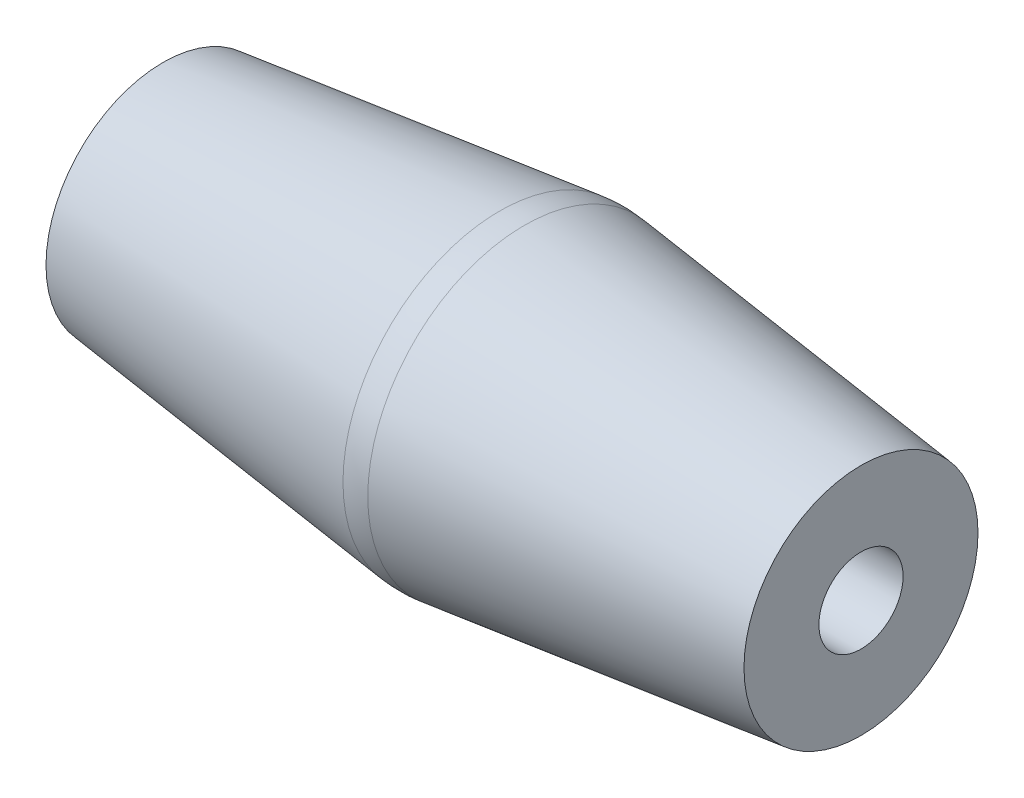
ISO-10303-21;
HEADER;
FILE_DESCRIPTION(('STEP AP214'),'2;1');
FILE_NAME('part.step','',(''),(''),'','','');
FILE_SCHEMA(('AUTOMOTIVE_DESIGN { 1 0 10303 214 1 1 1 1 }'));
ENDSEC;
DATA;
#1=APPLICATION_CONTEXT('core data for automotive mechanical design processes');
#2=APPLICATION_PROTOCOL_DEFINITION('international standard','automotive_design',2000,#1);
#3=PRODUCT_CONTEXT('',#1,'mechanical');
#4=PRODUCT('Part','Part','',(#3));
#5=PRODUCT_RELATED_PRODUCT_CATEGORY('part','',(#4));
#6=PRODUCT_DEFINITION_FORMATION('','',#4);
#7=PRODUCT_DEFINITION_CONTEXT('part definition',#1,'design');
#8=PRODUCT_DEFINITION('design','',#6,#7);
#9=PRODUCT_DEFINITION_SHAPE('','',#8);
#10=(LENGTH_UNIT() NAMED_UNIT(*) SI_UNIT(.MILLI.,.METRE.));
#11=(NAMED_UNIT(*) PLANE_ANGLE_UNIT() SI_UNIT($,.RADIAN.));
#12=(NAMED_UNIT(*) SI_UNIT($,.STERADIAN.) SOLID_ANGLE_UNIT());
#13=UNCERTAINTY_MEASURE_WITH_UNIT(LENGTH_MEASURE(1.E-05),#10,'distance_accuracy_value','');
#14=(GEOMETRIC_REPRESENTATION_CONTEXT(3) GLOBAL_UNCERTAINTY_ASSIGNED_CONTEXT((#13)) GLOBAL_UNIT_ASSIGNED_CONTEXT((#10,
#11,#12)) REPRESENTATION_CONTEXT('',''));
#15=CARTESIAN_POINT('',(0.,0.,0.));
#16=DIRECTION('',(0.,0.,1.));
#17=DIRECTION('',(1.,0.,0.));
#18=AXIS2_PLACEMENT_3D('',#15,#16,#17);
#19=CARTESIAN_POINT('',(-18.8934807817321,0.,2.43892387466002));
#20=DIRECTION('',(-1.,0.,0.));
#21=DIRECTION('',(0.,0.,1.));
#22=AXIS2_PLACEMENT_3D('',#19,#20,#21);
#23=PLANE('',#22);
#24=CARTESIAN_POINT('',(-18.8934807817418,0.,0.232298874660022));
#25=DIRECTION('',(1.,0.,0.));
#26=DIRECTION('',(0.,0.,-1.));
#27=AXIS2_PLACEMENT_3D('',#24,#25,#26);
#28=CIRCLE('',#27,4.41324999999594);
#29=CARTESIAN_POINT('',(-18.8934807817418,0.,-4.18095112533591));
#30=VERTEX_POINT('',#29);
#31=EDGE_CURVE('E56',#30,#30,#28,.T.);
#32=ORIENTED_EDGE('',*,*,#31,.F.);
#33=EDGE_LOOP('',(#32));
#34=FACE_BOUND('',#33,.T.);
#35=CARTESIAN_POINT('',(-18.8934807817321,0.,0.23229887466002));
#36=DIRECTION('',(1.,0.,0.));
#37=DIRECTION('',(0.,0.,-1.));
#38=AXIS2_PLACEMENT_3D('',#35,#36,#37);
#39=CIRCLE('',#38,1.5875);
#40=CARTESIAN_POINT('',(-18.8934807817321,0.,-1.35520112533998));
#41=VERTEX_POINT('',#40);
#42=EDGE_CURVE('E37',#41,#41,#39,.T.);
#43=ORIENTED_EDGE('',*,*,#42,.T.);
#44=EDGE_LOOP('',(#43));
#45=FACE_BOUND('',#44,.T.);
#46=ADVANCED_FACE('F33',(#34,#45),#23,.T.);
#47=CARTESIAN_POINT('',(-23.7900010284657,0.,0.232298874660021));
#48=DIRECTION('',(1.,0.,0.));
#49=DIRECTION('',(0.,0.,-1.));
#50=AXIS2_PLACEMENT_3D('',#47,#48,#49);
#51=CYLINDRICAL_SURFACE('',#50,1.5875);
#52=CARTESIAN_POINT('',(7.43351921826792,0.,0.232298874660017));
#53=DIRECTION('',(1.,0.,0.));
#54=DIRECTION('',(0.,0.,-1.));
#55=AXIS2_PLACEMENT_3D('',#52,#53,#54);
#56=CIRCLE('',#55,1.5875);
#57=CARTESIAN_POINT('',(7.43351921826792,0.,-1.35520112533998));
#58=VERTEX_POINT('',#57);
#59=EDGE_CURVE('E54',#58,#58,#56,.F.);
#60=ORIENTED_EDGE('',*,*,#59,.F.);
#61=EDGE_LOOP('',(#60));
#62=FACE_BOUND('',#61,.T.);
#63=ORIENTED_EDGE('',*,*,#42,.F.);
#64=EDGE_LOOP('',(#63));
#65=FACE_BOUND('',#64,.T.);
#66=ADVANCED_FACE('F64',(#62,#65),#51,.F.);
#67=CARTESIAN_POINT('',(-6.19756989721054,0.,0.232298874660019));
#68=DIRECTION('',(1.,0.,0.));
#69=DIRECTION('',(0.,0.,-1.));
#70=AXIS2_PLACEMENT_3D('',#67,#68,#69);
#71=CONICAL_SURFACE('',#70,5.90761277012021,0.117165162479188);
#72=CARTESIAN_POINT('',(-6.19756989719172,0.,0.232298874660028));
#73=DIRECTION('',(-1.,0.,0.));
#74=DIRECTION('',(0.,0.,1.));
#75=AXIS2_PLACEMENT_3D('',#72,#73,#74);
#76=CIRCLE('',#75,5.90761277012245);
#77=CARTESIAN_POINT('',(-6.19756989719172,0.,6.13991164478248));
#78=VERTEX_POINT('',#77);
#79=EDGE_CURVE('E46',#78,#78,#76,.T.);
#80=ORIENTED_EDGE('',*,*,#79,.T.);
#81=EDGE_LOOP('',(#80));
#82=FACE_BOUND('',#81,.T.);
#83=ORIENTED_EDGE('',*,*,#31,.T.);
#84=EDGE_LOOP('',(#83));
#85=FACE_BOUND('',#84,.T.);
#86=ADVANCED_FACE('F66',(#82,#85),#71,.T.);
#87=CARTESIAN_POINT('',(7.43351921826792,0.,2.43892387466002));
#88=DIRECTION('',(1.,0.,0.));
#89=DIRECTION('',(0.,0.,-1.));
#90=AXIS2_PLACEMENT_3D('',#87,#88,#89);
#91=PLANE('',#90);
#92=CARTESIAN_POINT('',(7.43351921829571,0.,0.232298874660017));
#93=DIRECTION('',(-1.,0.,0.));
#94=DIRECTION('',(0.,0.,1.));
#95=AXIS2_PLACEMENT_3D('',#92,#93,#94);
#96=CIRCLE('',#95,4.41324999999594);
#97=CARTESIAN_POINT('',(7.43351921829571,0.,4.64554887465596));
#98=VERTEX_POINT('',#97);
#99=EDGE_CURVE('E41',#98,#98,#96,.T.);
#100=ORIENTED_EDGE('',*,*,#99,.F.);
#101=EDGE_LOOP('',(#100));
#102=FACE_BOUND('',#101,.T.);
#103=ORIENTED_EDGE('',*,*,#59,.T.);
#104=EDGE_LOOP('',(#103));
#105=FACE_BOUND('',#104,.T.);
#106=ADVANCED_FACE('F73',(#102,#105),#91,.T.);
#107=CARTESIAN_POINT('',(-5.72998078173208,0.,0.232298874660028));
#108=DIRECTION('',(-1.,0.,0.));
#109=DIRECTION('',(0.,0.,1.));
#110=AXIS2_PLACEMENT_3D('',#107,#108,#109);
#111=DEGENERATE_TOROIDAL_SURFACE('',#110,1.93503672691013,4.0000000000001,.T.);
#112=CARTESIAN_POINT('',(-5.26239166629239,0.,0.232298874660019));
#113=DIRECTION('',(-1.,0.,0.));
#114=DIRECTION('',(0.,0.,1.));
#115=AXIS2_PLACEMENT_3D('',#112,#113,#114);
#116=CIRCLE('',#115,5.90761277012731);
#117=CARTESIAN_POINT('',(-5.26239166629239,0.,6.13991164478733));
#118=VERTEX_POINT('',#117);
#119=EDGE_CURVE('E10',#118,#118,#116,.F.);
#120=ORIENTED_EDGE('',*,*,#119,.F.);
#121=EDGE_LOOP('',(#120));
#122=FACE_BOUND('',#121,.T.);
#123=ORIENTED_EDGE('',*,*,#79,.F.);
#124=EDGE_LOOP('',(#123));
#125=FACE_BOUND('',#124,.T.);
#126=ADVANCED_FACE('F35',(#122,#125),#111,.T.);
#127=CARTESIAN_POINT('',(-5.26239166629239,0.,0.232298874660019));
#128=DIRECTION('',(-1.,0.,0.));
#129=DIRECTION('',(0.,0.,1.));
#130=AXIS2_PLACEMENT_3D('',#127,#128,#129);
#131=CONICAL_SURFACE('',#130,5.90761277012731,0.117165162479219);
#132=ORIENTED_EDGE('',*,*,#119,.T.);
#133=EDGE_LOOP('',(#132));
#134=FACE_BOUND('',#133,.T.);
#135=ORIENTED_EDGE('',*,*,#99,.T.);
#136=EDGE_LOOP('',(#135));
#137=FACE_BOUND('',#136,.T.);
#138=ADVANCED_FACE('F82',(#134,#137),#131,.T.);
#139=CLOSED_SHELL('',(#46,#66,#86,#106,#126,#138));
#140=MANIFOLD_SOLID_BREP('B2',#139);
#141=ADVANCED_BREP_SHAPE_REPRESENTATION('',(#18,#140),#14);
#142=SHAPE_DEFINITION_REPRESENTATION(#9,#141);
ENDSEC;
END-ISO-10303-21;
